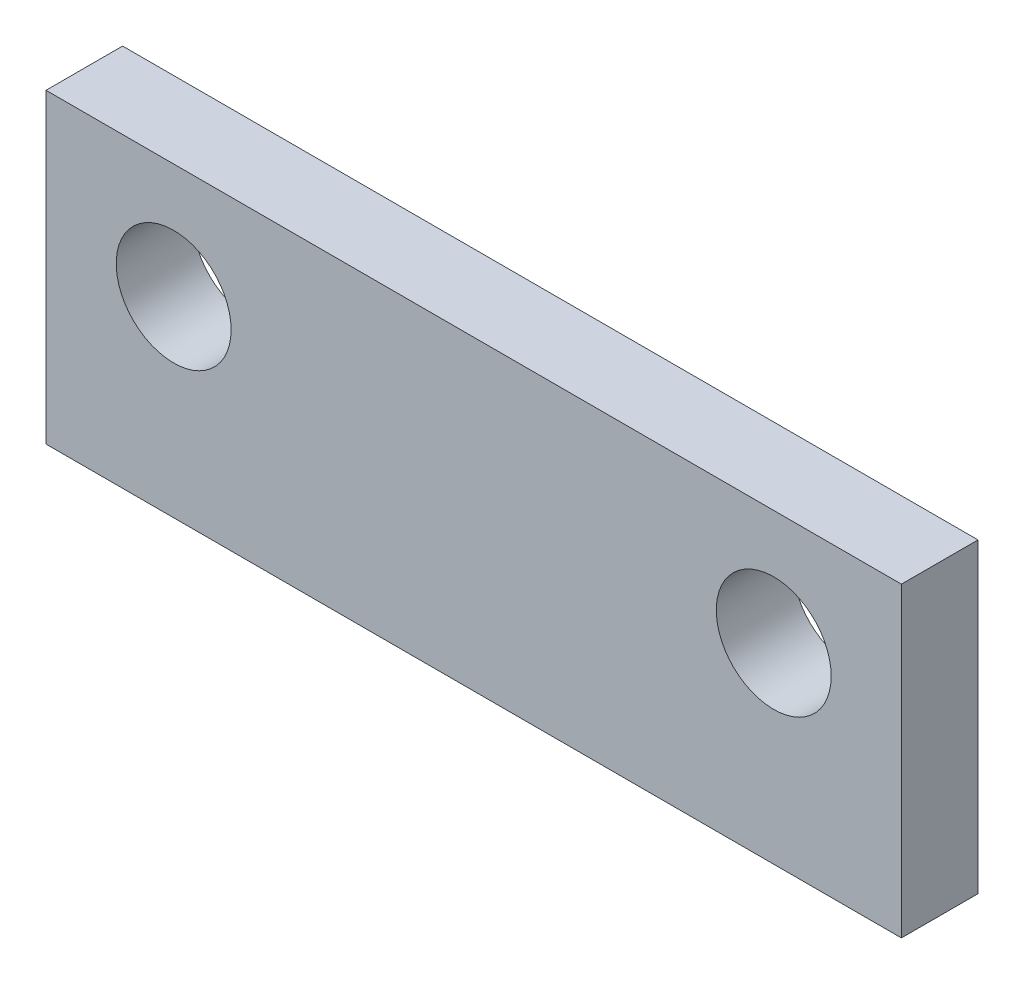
ISO-10303-21;
HEADER;
FILE_DESCRIPTION(('STEP AP214'),'2;1');
FILE_NAME('part.step','',(''),(''),'','','');
FILE_SCHEMA(('AUTOMOTIVE_DESIGN { 1 0 10303 214 1 1 1 1 }'));
ENDSEC;
DATA;
#1=APPLICATION_CONTEXT('core data for automotive mechanical design processes');
#2=APPLICATION_PROTOCOL_DEFINITION('international standard','automotive_design',2000,#1);
#3=PRODUCT_CONTEXT('',#1,'mechanical');
#4=PRODUCT('Part','Part','',(#3));
#5=PRODUCT_RELATED_PRODUCT_CATEGORY('part','',(#4));
#6=PRODUCT_DEFINITION_FORMATION('','',#4);
#7=PRODUCT_DEFINITION_CONTEXT('part definition',#1,'design');
#8=PRODUCT_DEFINITION('design','',#6,#7);
#9=PRODUCT_DEFINITION_SHAPE('','',#8);
#10=(LENGTH_UNIT() NAMED_UNIT(*) SI_UNIT(.MILLI.,.METRE.));
#11=(NAMED_UNIT(*) PLANE_ANGLE_UNIT() SI_UNIT($,.RADIAN.));
#12=(NAMED_UNIT(*) SI_UNIT($,.STERADIAN.) SOLID_ANGLE_UNIT());
#13=UNCERTAINTY_MEASURE_WITH_UNIT(LENGTH_MEASURE(1.E-05),#10,'distance_accuracy_value','');
#14=(GEOMETRIC_REPRESENTATION_CONTEXT(3) GLOBAL_UNCERTAINTY_ASSIGNED_CONTEXT((#13)) GLOBAL_UNIT_ASSIGNED_CONTEXT((#10,
#11,#12)) REPRESENTATION_CONTEXT('',''));
#15=CARTESIAN_POINT('',(0.,0.,0.));
#16=DIRECTION('',(0.,0.,1.));
#17=DIRECTION('',(1.,0.,0.));
#18=AXIS2_PLACEMENT_3D('',#15,#16,#17);
#19=CARTESIAN_POINT('',(0.,0.,3.));
#20=DIRECTION('',(0.,0.,-1.));
#21=DIRECTION('',(-1.,0.,0.));
#22=AXIS2_PLACEMENT_3D('',#19,#20,#21);
#23=PLANE('',#22);
#24=CARTESIAN_POINT('',(5.,-4.5,3.));
#25=DIRECTION('',(0.,0.,1.));
#26=DIRECTION('',(1.,0.,0.));
#27=AXIS2_PLACEMENT_3D('',#24,#25,#26);
#28=CIRCLE('',#27,2.25);
#29=CARTESIAN_POINT('',(7.25,-4.5,3.));
#30=VERTEX_POINT('',#29);
#31=EDGE_CURVE('E99',#30,#30,#28,.T.);
#32=ORIENTED_EDGE('',*,*,#31,.F.);
#33=EDGE_LOOP('',(#32));
#34=FACE_BOUND('',#33,.T.);
#35=DIRECTION('',(0.,-1.,0.));
#36=VECTOR('',#35,1.);
#37=CARTESIAN_POINT('',(0.,-12.,3.));
#38=LINE('',#37,#36);
#39=CARTESIAN_POINT('',(0.,0.,3.));
#40=VERTEX_POINT('',#39);
#41=CARTESIAN_POINT('',(0.,-12.,3.));
#42=VERTEX_POINT('',#41);
#43=EDGE_CURVE('E84',#40,#42,#38,.T.);
#44=ORIENTED_EDGE('',*,*,#43,.T.);
#45=DIRECTION('',(1.,0.,0.));
#46=VECTOR('',#45,1.);
#47=CARTESIAN_POINT('',(0.,-12.,3.));
#48=LINE('',#47,#46);
#49=CARTESIAN_POINT('',(33.5,-12.,3.));
#50=VERTEX_POINT('',#49);
#51=EDGE_CURVE('E79',#42,#50,#48,.T.);
#52=ORIENTED_EDGE('',*,*,#51,.T.);
#53=DIRECTION('',(0.,1.,0.));
#54=VECTOR('',#53,1.);
#55=CARTESIAN_POINT('',(33.5,-12.,3.));
#56=LINE('',#55,#54);
#57=CARTESIAN_POINT('',(33.5,0.,3.));
#58=VERTEX_POINT('',#57);
#59=EDGE_CURVE('E82',#50,#58,#56,.T.);
#60=ORIENTED_EDGE('',*,*,#59,.T.);
#61=DIRECTION('',(-1.,0.,0.));
#62=VECTOR('',#61,1.);
#63=CARTESIAN_POINT('',(0.,0.,3.));
#64=LINE('',#63,#62);
#65=EDGE_CURVE('E49',#58,#40,#64,.T.);
#66=ORIENTED_EDGE('',*,*,#65,.T.);
#67=EDGE_LOOP('',(#44,#52,#60,#66));
#68=FACE_BOUND('',#67,.T.);
#69=CARTESIAN_POINT('',(28.5,-4.5,3.));
#70=DIRECTION('',(0.,0.,1.));
#71=DIRECTION('',(1.,0.,0.));
#72=AXIS2_PLACEMENT_3D('',#69,#70,#71);
#73=CIRCLE('',#72,2.25);
#74=CARTESIAN_POINT('',(30.75,-4.5,3.));
#75=VERTEX_POINT('',#74);
#76=EDGE_CURVE('E114',#75,#75,#73,.T.);
#77=ORIENTED_EDGE('',*,*,#76,.F.);
#78=EDGE_LOOP('',(#77));
#79=FACE_BOUND('',#78,.T.);
#80=ADVANCED_FACE('F32',(#34,#68,#79),#23,.F.);
#81=CARTESIAN_POINT('',(0.,0.,0.));
#82=DIRECTION('',(0.,0.,-1.));
#83=DIRECTION('',(-1.,0.,0.));
#84=AXIS2_PLACEMENT_3D('',#81,#82,#83);
#85=PLANE('',#84);
#86=CARTESIAN_POINT('',(5.,-4.5,0.));
#87=DIRECTION('',(0.,0.,1.));
#88=DIRECTION('',(1.,0.,0.));
#89=AXIS2_PLACEMENT_3D('',#86,#87,#88);
#90=CIRCLE('',#89,2.25);
#91=CARTESIAN_POINT('',(7.25,-4.5,0.));
#92=VERTEX_POINT('',#91);
#93=EDGE_CURVE('E111',#92,#92,#90,.T.);
#94=ORIENTED_EDGE('',*,*,#93,.T.);
#95=EDGE_LOOP('',(#94));
#96=FACE_BOUND('',#95,.T.);
#97=DIRECTION('',(0.,-1.,0.));
#98=VECTOR('',#97,1.);
#99=CARTESIAN_POINT('',(0.,-12.,0.));
#100=LINE('',#99,#98);
#101=CARTESIAN_POINT('',(0.,0.,0.));
#102=VERTEX_POINT('',#101);
#103=CARTESIAN_POINT('',(0.,-12.,0.));
#104=VERTEX_POINT('',#103);
#105=EDGE_CURVE('E96',#102,#104,#100,.T.);
#106=ORIENTED_EDGE('',*,*,#105,.F.);
#107=DIRECTION('',(-1.,0.,0.));
#108=VECTOR('',#107,1.);
#109=CARTESIAN_POINT('',(0.,0.,0.));
#110=LINE('',#109,#108);
#111=CARTESIAN_POINT('',(33.5,0.,0.));
#112=VERTEX_POINT('',#111);
#113=EDGE_CURVE('E72',#112,#102,#110,.T.);
#114=ORIENTED_EDGE('',*,*,#113,.F.);
#115=DIRECTION('',(0.,1.,0.));
#116=VECTOR('',#115,1.);
#117=CARTESIAN_POINT('',(33.5,-12.,0.));
#118=LINE('',#117,#116);
#119=CARTESIAN_POINT('',(33.5,-12.,0.));
#120=VERTEX_POINT('',#119);
#121=EDGE_CURVE('E66',#120,#112,#118,.T.);
#122=ORIENTED_EDGE('',*,*,#121,.F.);
#123=DIRECTION('',(1.,0.,0.));
#124=VECTOR('',#123,1.);
#125=CARTESIAN_POINT('',(0.,-12.,0.));
#126=LINE('',#125,#124);
#127=EDGE_CURVE('E88',#104,#120,#126,.T.);
#128=ORIENTED_EDGE('',*,*,#127,.F.);
#129=EDGE_LOOP('',(#106,#114,#122,#128));
#130=FACE_BOUND('',#129,.T.);
#131=CARTESIAN_POINT('',(28.5,-4.5,0.));
#132=DIRECTION('',(0.,0.,1.));
#133=DIRECTION('',(1.,0.,0.));
#134=AXIS2_PLACEMENT_3D('',#131,#132,#133);
#135=CIRCLE('',#134,2.25);
#136=CARTESIAN_POINT('',(30.75,-4.5,0.));
#137=VERTEX_POINT('',#136);
#138=EDGE_CURVE('E117',#137,#137,#135,.T.);
#139=ORIENTED_EDGE('',*,*,#138,.T.);
#140=EDGE_LOOP('',(#139));
#141=FACE_BOUND('',#140,.T.);
#142=ADVANCED_FACE('F107',(#96,#130,#141),#85,.T.);
#143=CARTESIAN_POINT('',(0.,-12.,3.));
#144=DIRECTION('',(1.,0.,0.));
#145=DIRECTION('',(0.,0.,-1.));
#146=AXIS2_PLACEMENT_3D('',#143,#144,#145);
#147=PLANE('',#146);
#148=ORIENTED_EDGE('',*,*,#105,.T.);
#149=DIRECTION('',(0.,0.,-1.));
#150=VECTOR('',#149,1.);
#151=CARTESIAN_POINT('',(0.,-12.,3.));
#152=LINE('',#151,#150);
#153=EDGE_CURVE('E11',#42,#104,#152,.T.);
#154=ORIENTED_EDGE('',*,*,#153,.F.);
#155=ORIENTED_EDGE('',*,*,#43,.F.);
#156=DIRECTION('',(0.,0.,-1.));
#157=VECTOR('',#156,1.);
#158=CARTESIAN_POINT('',(0.,0.,3.));
#159=LINE('',#158,#157);
#160=EDGE_CURVE('E92',#40,#102,#159,.T.);
#161=ORIENTED_EDGE('',*,*,#160,.T.);
#162=EDGE_LOOP('',(#148,#154,#155,#161));
#163=FACE_BOUND('',#162,.T.);
#164=ADVANCED_FACE('F34',(#163),#147,.F.);
#165=CARTESIAN_POINT('',(0.,-12.,3.));
#166=DIRECTION('',(0.,1.,0.));
#167=DIRECTION('',(0.,0.,1.));
#168=AXIS2_PLACEMENT_3D('',#165,#166,#167);
#169=PLANE('',#168);
#170=ORIENTED_EDGE('',*,*,#127,.T.);
#171=DIRECTION('',(0.,0.,-1.));
#172=VECTOR('',#171,1.);
#173=CARTESIAN_POINT('',(33.5,-12.,3.));
#174=LINE('',#173,#172);
#175=EDGE_CURVE('E41',#50,#120,#174,.T.);
#176=ORIENTED_EDGE('',*,*,#175,.F.);
#177=ORIENTED_EDGE('',*,*,#51,.F.);
#178=ORIENTED_EDGE('',*,*,#153,.T.);
#179=EDGE_LOOP('',(#170,#176,#177,#178));
#180=FACE_BOUND('',#179,.T.);
#181=ADVANCED_FACE('F87',(#180),#169,.F.);
#182=CARTESIAN_POINT('',(33.5,-12.,3.));
#183=DIRECTION('',(-1.,0.,0.));
#184=DIRECTION('',(0.,0.,1.));
#185=AXIS2_PLACEMENT_3D('',#182,#183,#184);
#186=PLANE('',#185);
#187=ORIENTED_EDGE('',*,*,#121,.T.);
#188=DIRECTION('',(0.,0.,-1.));
#189=VECTOR('',#188,1.);
#190=CARTESIAN_POINT('',(33.5,0.,3.));
#191=LINE('',#190,#189);
#192=EDGE_CURVE('E89',#58,#112,#191,.T.);
#193=ORIENTED_EDGE('',*,*,#192,.F.);
#194=ORIENTED_EDGE('',*,*,#59,.F.);
#195=ORIENTED_EDGE('',*,*,#175,.T.);
#196=EDGE_LOOP('',(#187,#193,#194,#195));
#197=FACE_BOUND('',#196,.T.);
#198=ADVANCED_FACE('F90',(#197),#186,.F.);
#199=CARTESIAN_POINT('',(0.,0.,3.));
#200=DIRECTION('',(0.,-1.,0.));
#201=DIRECTION('',(0.,0.,-1.));
#202=AXIS2_PLACEMENT_3D('',#199,#200,#201);
#203=PLANE('',#202);
#204=ORIENTED_EDGE('',*,*,#113,.T.);
#205=ORIENTED_EDGE('',*,*,#160,.F.);
#206=ORIENTED_EDGE('',*,*,#65,.F.);
#207=ORIENTED_EDGE('',*,*,#192,.T.);
#208=EDGE_LOOP('',(#204,#205,#206,#207));
#209=FACE_BOUND('',#208,.T.);
#210=ADVANCED_FACE('F104',(#209),#203,.F.);
#211=CARTESIAN_POINT('',(5.,-4.5,3.));
#212=DIRECTION('',(0.,0.,-1.));
#213=DIRECTION('',(-1.,0.,0.));
#214=AXIS2_PLACEMENT_3D('',#211,#212,#213);
#215=CYLINDRICAL_SURFACE('',#214,2.25);
#216=ORIENTED_EDGE('',*,*,#31,.T.);
#217=EDGE_LOOP('',(#216));
#218=FACE_BOUND('',#217,.T.);
#219=ORIENTED_EDGE('',*,*,#93,.F.);
#220=EDGE_LOOP('',(#219));
#221=FACE_BOUND('',#220,.T.);
#222=ADVANCED_FACE('F135',(#218,#221),#215,.F.);
#223=CARTESIAN_POINT('',(28.5,-4.5,3.));
#224=DIRECTION('',(0.,0.,-1.));
#225=DIRECTION('',(-1.,0.,0.));
#226=AXIS2_PLACEMENT_3D('',#223,#224,#225);
#227=CYLINDRICAL_SURFACE('',#226,2.25);
#228=ORIENTED_EDGE('',*,*,#76,.T.);
#229=EDGE_LOOP('',(#228));
#230=FACE_BOUND('',#229,.T.);
#231=ORIENTED_EDGE('',*,*,#138,.F.);
#232=EDGE_LOOP('',(#231));
#233=FACE_BOUND('',#232,.T.);
#234=ADVANCED_FACE('F123',(#230,#233),#227,.F.);
#235=CLOSED_SHELL('',(#80,#142,#164,#181,#198,#210,#222,#234));
#236=MANIFOLD_SOLID_BREP('B2',#235);
#237=ADVANCED_BREP_SHAPE_REPRESENTATION('',(#18,#236),#14);
#238=SHAPE_DEFINITION_REPRESENTATION(#9,#237);
ENDSEC;
END-ISO-10303-21;
